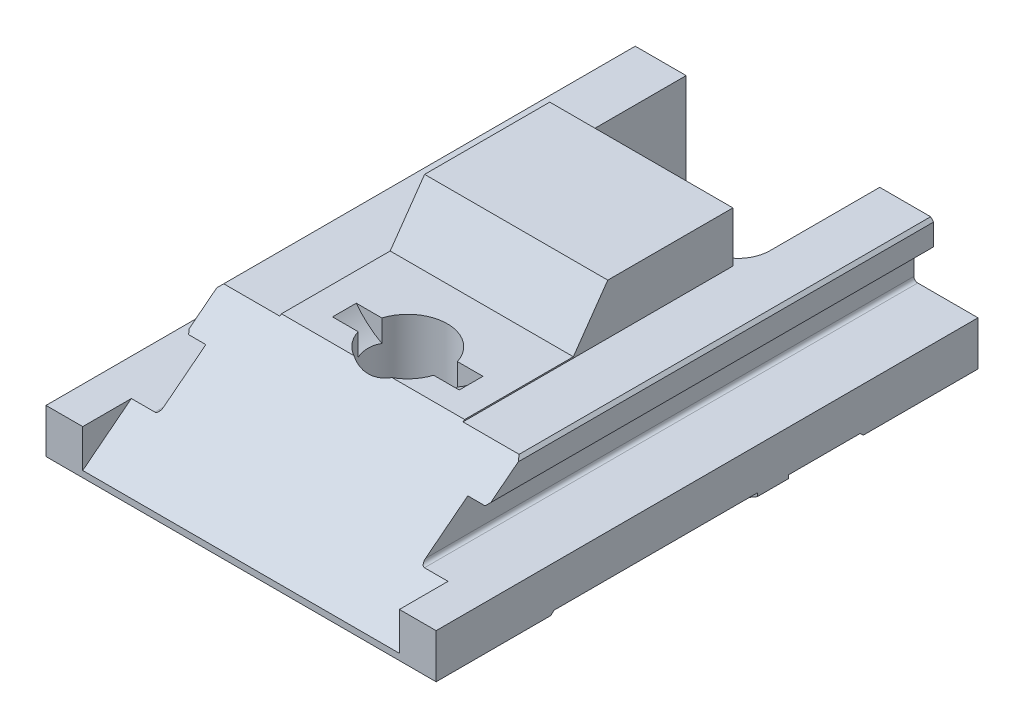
from build123d import *

# Parameters (mm, degrees)
EXTRUDE_1_DEPTH     = 54.3306
CUT_EXTRUDE_1_DEPTH = 70.101058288
SKETCH_6_R          = 3.96875
CUT_EXTRUDE_5_DEPTH = 61.227984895
SKETCH_3_W          = 14.1986
SKETCH_3_H          = 5.0546
CUT_EXTRUDE_2_DEPTH = 15.875
CUT_EXTRUDE_3_REACH = 67.677
CUT_EXTRUDE_4_DEPTH = 1.9812
CUT_EXTRUDE_6_DEPTH = 1.190625


with BuildPart() as part:
    # Sketch 1 → Extrude 1 (new body)
    with BuildSketch(Plane.XY):
        with BuildLine():
            Line((-9.1821, 0), (9.1821, 0))
            Line((9.1821, 0), (9.1821, -5.0546))
            Line((9.1821, -5.0546), (14.8082, -5.0546))
            Line((14.8082, -5.0546), (15.113, -5.3594))
            Line((15.113, -5.3594), (15.113, -7.5184))
            Line((15.113, -7.5184), (14.8082, -7.8232))
            Line((14.8082, -7.8232), (13.5128, -7.8232))
            ThreePointArc((13.5128, -7.8232), (13.243392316, -7.934792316), (13.1318, -8.2042))
            Line((13.1318, -8.2042), (13.1318, -11.0744))
            ThreePointArc((13.1318, -11.0744), (13.243392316, -11.343807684), (13.5128, -11.4554))
            Line((13.5128, -11.4554), (19.558, -11.4554))
            Line((19.558, -11.4554), (19.558, -15.928975))
            Line((19.558, -15.928975), (17.495777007, -17.1196))
            Line((17.495777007, -17.1196), (-17.495777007, -17.1196))
            Line((-17.495777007, -17.1196), (-19.558, -15.928975))
            Line((-19.558, -15.928975), (-19.558, -11.4554))
            Line((-19.558, -11.4554), (-13.5128, -11.4554))
            ThreePointArc((-13.5128, -11.4554), (-13.243392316, -11.343807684), (-13.1318, -11.0744))
            Line((-13.1318, -11.0744), (-13.1318, -8.2042))
            ThreePointArc((-13.1318, -8.2042), (-13.243392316, -7.934792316), (-13.5128, -7.8232))
            Line((-13.5128, -7.8232), (-14.8082, -7.8232))
            Line((-14.8082, -7.8232), (-15.113, -7.5184))
            Line((-15.113, -7.5184), (-15.113, -5.3594))
            Line((-15.113, -5.3594), (-14.8082, -5.0546))
            Line((-14.8082, -5.0546), (-9.1821, -5.0546))
            Line((-9.1821, -5.0546), (-9.1821, 0))
        make_face()
    extrude(amount=EXTRUDE_1_DEPTH)

    # Sketch 2 → Cut-Extrude 1 (cut, through all)
    with BuildSketch(Plane(origin=(19.558, 0, 0), x_dir=(0, 0, -1), z_dir=(1, 0, 0))):
        Polygon((-54.3306, -17.1196), (-22.1234, -17.1196), (-22.1234, -15.5956), (-42.516425, -15.5956), (-42.821225, -15.9004), (-54.3306, -15.9004), align=None)
        Polygon((-19.0246, -17.1196), (-19.0246, -15.5956), (-11.814175, -15.5956), (-11.509375, -15.9004), (0, -15.9004), (0, -17.1196), align=None)
    extrude(amount=-CUT_EXTRUDE_1_DEPTH, mode=Mode.SUBTRACT)

    # Sketch 6 → Cut-Extrude 5 (cut, through all)
    with BuildSketch(Plane(origin=(0, 0, 0), x_dir=(1, 0, 0), z_dir=(0, 1, 0))):
        with Locations(Location((0, -37.6174, 0), (0, 0, 270))):
            Circle(SKETCH_6_R)
        with BuildLine():
            Line((9.7028, 0), (-9.7028, 0))
            Line((-9.7028, 0), (-9.7028, -11.0236))
            ThreePointArc((-9.7028, -11.0236), (-8.77286403, -13.26866403), (-6.5278, -14.1986))
            Line((-6.5278, -14.1986), (6.5278, -14.1986))
            ThreePointArc((6.5278, -14.1986), (8.77286403, -13.26866403), (9.7028, -11.0236))
            Line((9.7028, -11.0236), (9.7028, 0))
        make_face()
    extrude(amount=-CUT_EXTRUDE_5_DEPTH, mode=Mode.SUBTRACT)

    # Sketch 3 → Cut-Extrude 2 (cut, symmetric)
    with BuildSketch(Plane(origin=(0, 0, 0), x_dir=(0, 0, -1), z_dir=(1, 0, 0))):
        Polygon((-54.3306, -15.2654), (-54.3306, 0), (-26.7462, 0), (-30.196542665, -4.9276), (-41.098819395, -4.9276), align=None)
        with Locations((-7.0993, -2.5273)):
            Rectangle(SKETCH_3_W, SKETCH_3_H)
    extrude(amount=CUT_EXTRUDE_2_DEPTH, both=True, mode=Mode.SUBTRACT)

    # Cut-Extrude 3: up to this face of the body (flat: up to its plane)
    cut_extrude_3_end = Plane(part.part.faces().sort_by_distance((15.113, -6.450453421, 21.523991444))[0])
    # Sketch 4 → Cut-Extrude 3 (cut, up to the picked face)
    with BuildSketch(Plane(origin=(13.1318, 0, 0), x_dir=(0, 0, -1), z_dir=(1, 0, 0)), mode=Mode.PRIVATE) as cut_extrude_3_sk1:
        Polygon((-44.289320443, -8.2042), (-44.7294, -7.764120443), (-45.292676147, -8.2042), align=None)
    cut_extrude_3_tool1 = split(extrude(cut_extrude_3_sk1.sketch, amount=CUT_EXTRUDE_3_REACH, mode=Mode.PRIVATE), bisect_by=cut_extrude_3_end, keep=Keep.BOTH, mode=Mode.PRIVATE)
    add(cut_extrude_3_tool1.solids().sort_by(Axis((13.1318, -8.057507, 44.770466), (1, 0, 0)))[0], mode=Mode.SUBTRACT)

    # Sketch 5 → Cut-Extrude 4 (cut)
    with BuildSketch(Plane.ZY.offset(13.1318)):
        Polygon((45.292676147, -8.2042), (44.289320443, -8.2042), (44.7294, -7.764120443), align=None)
    extrude(amount=CUT_EXTRUDE_4_DEPTH, mode=Mode.SUBTRACT)

    # Sketch 7 → Cut-Extrude 6 (cut, symmetric)
    with BuildSketch(Plane.XY.offset(37.6174)):
        with BuildLine():
            Line((-6.35, -4.9276), (6.35, -4.9276))
            ThreePointArc((6.35, -4.9276), (0, -8.1026), (-6.35, -4.9276))
        make_face()
    extrude(amount=CUT_EXTRUDE_6_DEPTH, both=True, mode=Mode.SUBTRACT)

    # Sketch 8 → Cut-Revolve 1 (revolve, cut)
    with BuildSketch(Plane(origin=(0, 0, 0), x_dir=(0, 0, -1), z_dir=(1, 0, 0)), mode=Mode.PRIVATE) as cut_revolve_1_sk:
        Polygon((-37.6174, -10.03935), (-43.47845, -15.9004), (-37.6174, -15.9004), align=None)
    revolve(cut_revolve_1_sk.sketch.rotate(Axis((0, -12.197218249, 37.6174), (0, -1, 0)), 28.692617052), axis=Axis((0, -12.197218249, 37.6174), (0, -1, 0)), mode=Mode.SUBTRACT)


solid = part.part
